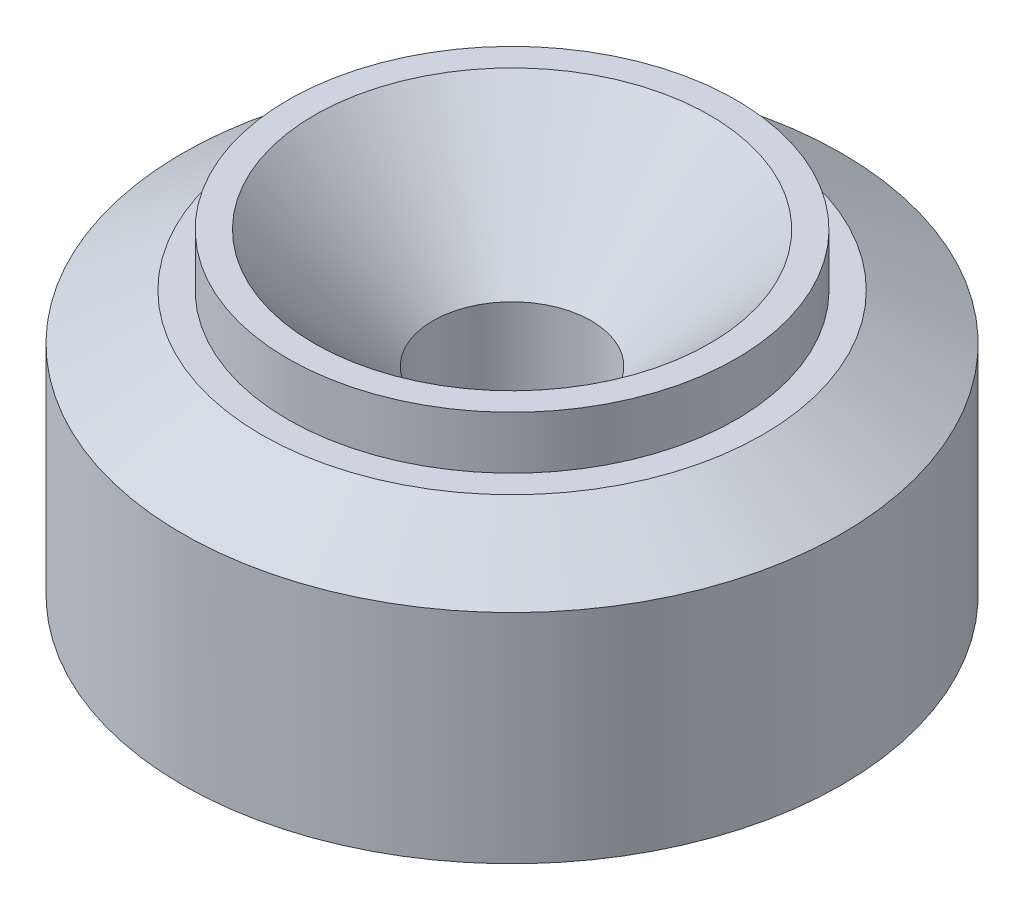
ISO-10303-21;
HEADER;
FILE_DESCRIPTION(('STEP AP214'),'2;1');
FILE_NAME('part.step','',(''),(''),'','','');
FILE_SCHEMA(('AUTOMOTIVE_DESIGN { 1 0 10303 214 1 1 1 1 }'));
ENDSEC;
DATA;
#1=APPLICATION_CONTEXT('core data for automotive mechanical design processes');
#2=APPLICATION_PROTOCOL_DEFINITION('international standard','automotive_design',2000,#1);
#3=PRODUCT_CONTEXT('',#1,'mechanical');
#4=PRODUCT('Part','Part','',(#3));
#5=PRODUCT_RELATED_PRODUCT_CATEGORY('part','',(#4));
#6=PRODUCT_DEFINITION_FORMATION('','',#4);
#7=PRODUCT_DEFINITION_CONTEXT('part definition',#1,'design');
#8=PRODUCT_DEFINITION('design','',#6,#7);
#9=PRODUCT_DEFINITION_SHAPE('','',#8);
#10=(LENGTH_UNIT() NAMED_UNIT(*) SI_UNIT(.MILLI.,.METRE.));
#11=(NAMED_UNIT(*) PLANE_ANGLE_UNIT() SI_UNIT($,.RADIAN.));
#12=(NAMED_UNIT(*) SI_UNIT($,.STERADIAN.) SOLID_ANGLE_UNIT());
#13=UNCERTAINTY_MEASURE_WITH_UNIT(LENGTH_MEASURE(1.E-05),#10,'distance_accuracy_value','');
#14=(GEOMETRIC_REPRESENTATION_CONTEXT(3) GLOBAL_UNCERTAINTY_ASSIGNED_CONTEXT((#13)) GLOBAL_UNIT_ASSIGNED_CONTEXT((#10,
#11,#12)) REPRESENTATION_CONTEXT('',''));
#15=CARTESIAN_POINT('',(0.,0.,0.));
#16=DIRECTION('',(0.,0.,1.));
#17=DIRECTION('',(1.,0.,0.));
#18=AXIS2_PLACEMENT_3D('',#15,#16,#17);
#19=CARTESIAN_POINT('',(0.,12.,0.));
#20=DIRECTION('',(0.,-1.,0.));
#21=DIRECTION('',(0.,0.,-1.));
#22=AXIS2_PLACEMENT_3D('',#19,#20,#21);
#23=CYLINDRICAL_SURFACE('',#22,12.5);
#24=CARTESIAN_POINT('',(0.,8.25,0.));
#25=DIRECTION('',(0.,1.,0.));
#26=DIRECTION('',(0.,0.,1.));
#27=AXIS2_PLACEMENT_3D('',#24,#25,#26);
#28=CIRCLE('',#27,12.5);
#29=CARTESIAN_POINT('',(0.,8.25,-12.5));
#30=VERTEX_POINT('',#29);
#31=EDGE_CURVE('E11',#30,#30,#28,.F.);
#32=ORIENTED_EDGE('',*,*,#31,.T.);
#33=EDGE_LOOP('',(#32));
#34=FACE_BOUND('',#33,.T.);
#35=CARTESIAN_POINT('',(0.,0.,0.));
#36=DIRECTION('',(0.,1.,0.));
#37=DIRECTION('',(0.,0.,1.));
#38=AXIS2_PLACEMENT_3D('',#35,#36,#37);
#39=CIRCLE('',#38,12.5);
#40=CARTESIAN_POINT('',(0.,0.,12.5));
#41=VERTEX_POINT('',#40);
#42=EDGE_CURVE('E43',#41,#41,#39,.T.);
#43=ORIENTED_EDGE('',*,*,#42,.T.);
#44=EDGE_LOOP('',(#43));
#45=FACE_BOUND('',#44,.T.);
#46=ADVANCED_FACE('F32',(#34,#45),#23,.T.);
#47=CARTESIAN_POINT('',(0.,12.,0.));
#48=DIRECTION('',(0.,1.,0.));
#49=DIRECTION('',(0.,0.,1.));
#50=AXIS2_PLACEMENT_3D('',#47,#48,#49);
#51=PLANE('',#50);
#52=CARTESIAN_POINT('',(0.,12.,0.));
#53=DIRECTION('',(0.,1.,0.));
#54=DIRECTION('',(0.,0.,1.));
#55=AXIS2_PLACEMENT_3D('',#52,#53,#54);
#56=CIRCLE('',#55,7.5);
#57=CARTESIAN_POINT('',(0.,12.,7.5));
#58=VERTEX_POINT('',#57);
#59=EDGE_CURVE('E61',#58,#58,#56,.T.);
#60=ORIENTED_EDGE('',*,*,#59,.F.);
#61=EDGE_LOOP('',(#60));
#62=FACE_BOUND('',#61,.T.);
#63=CARTESIAN_POINT('',(0.,12.,0.));
#64=DIRECTION('',(0.,1.,0.));
#65=DIRECTION('',(0.,0.,1.));
#66=AXIS2_PLACEMENT_3D('',#63,#64,#65);
#67=CIRCLE('',#66,8.5);
#68=CARTESIAN_POINT('',(0.,12.,8.5));
#69=VERTEX_POINT('',#68);
#70=EDGE_CURVE('E65',#69,#69,#67,.T.);
#71=ORIENTED_EDGE('',*,*,#70,.T.);
#72=EDGE_LOOP('',(#71));
#73=FACE_BOUND('',#72,.T.);
#74=ADVANCED_FACE('F87',(#62,#73),#51,.T.);
#75=CARTESIAN_POINT('',(0.,0.,0.));
#76=DIRECTION('',(0.,1.,0.));
#77=DIRECTION('',(0.,0.,1.));
#78=AXIS2_PLACEMENT_3D('',#75,#76,#77);
#79=PLANE('',#78);
#80=CARTESIAN_POINT('',(0.,0.,0.));
#81=DIRECTION('',(0.,-1.,0.));
#82=DIRECTION('',(0.,0.,-1.));
#83=AXIS2_PLACEMENT_3D('',#80,#81,#82);
#84=CIRCLE('',#83,7.);
#85=CARTESIAN_POINT('',(0.,0.,-7.));
#86=VERTEX_POINT('',#85);
#87=EDGE_CURVE('E50',#86,#86,#84,.T.);
#88=ORIENTED_EDGE('',*,*,#87,.F.);
#89=EDGE_LOOP('',(#88));
#90=FACE_BOUND('',#89,.T.);
#91=ORIENTED_EDGE('',*,*,#42,.F.);
#92=EDGE_LOOP('',(#91));
#93=FACE_BOUND('',#92,.T.);
#94=ADVANCED_FACE('F91',(#90,#93),#79,.F.);
#95=CARTESIAN_POINT('',(0.,2.,0.));
#96=DIRECTION('',(0.,-1.,0.));
#97=DIRECTION('',(0.,0.,-1.));
#98=AXIS2_PLACEMENT_3D('',#95,#96,#97);
#99=CYLINDRICAL_SURFACE('',#98,7.);
#100=CARTESIAN_POINT('',(0.,2.,0.));
#101=DIRECTION('',(0.,-1.,0.));
#102=DIRECTION('',(0.,0.,-1.));
#103=AXIS2_PLACEMENT_3D('',#100,#101,#102);
#104=CIRCLE('',#103,7.);
#105=CARTESIAN_POINT('',(0.,2.,-7.));
#106=VERTEX_POINT('',#105);
#107=EDGE_CURVE('E47',#106,#106,#104,.T.);
#108=ORIENTED_EDGE('',*,*,#107,.F.);
#109=EDGE_LOOP('',(#108));
#110=FACE_BOUND('',#109,.T.);
#111=ORIENTED_EDGE('',*,*,#87,.T.);
#112=EDGE_LOOP('',(#111));
#113=FACE_BOUND('',#112,.T.);
#114=ADVANCED_FACE('F97',(#110,#113),#99,.F.);
#115=CARTESIAN_POINT('',(0.,2.,0.));
#116=DIRECTION('',(0.,-1.,0.));
#117=DIRECTION('',(0.,0.,-1.));
#118=AXIS2_PLACEMENT_3D('',#115,#116,#117);
#119=PLANE('',#118);
#120=CARTESIAN_POINT('',(0.,2.,0.));
#121=DIRECTION('',(0.,-1.,0.));
#122=DIRECTION('',(0.,0.,-1.));
#123=AXIS2_PLACEMENT_3D('',#120,#121,#122);
#124=CIRCLE('',#123,3.);
#125=CARTESIAN_POINT('',(0.,2.,-3.));
#126=VERTEX_POINT('',#125);
#127=EDGE_CURVE('E53',#126,#126,#124,.T.);
#128=ORIENTED_EDGE('',*,*,#127,.F.);
#129=EDGE_LOOP('',(#128));
#130=FACE_BOUND('',#129,.T.);
#131=ORIENTED_EDGE('',*,*,#107,.T.);
#132=EDGE_LOOP('',(#131));
#133=FACE_BOUND('',#132,.T.);
#134=ADVANCED_FACE('F102',(#130,#133),#119,.T.);
#135=CARTESIAN_POINT('',(0.,7.5,0.));
#136=DIRECTION('',(0.,-1.,0.));
#137=DIRECTION('',(0.,0.,-1.));
#138=AXIS2_PLACEMENT_3D('',#135,#136,#137);
#139=CYLINDRICAL_SURFACE('',#138,3.);
#140=CARTESIAN_POINT('',(0.,7.5,0.));
#141=DIRECTION('',(0.,1.,0.));
#142=DIRECTION('',(0.,0.,1.));
#143=AXIS2_PLACEMENT_3D('',#140,#141,#142);
#144=CIRCLE('',#143,2.99999999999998);
#145=CARTESIAN_POINT('',(0.,7.5,2.99999999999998));
#146=VERTEX_POINT('',#145);
#147=EDGE_CURVE('E58',#146,#146,#144,.T.);
#148=ORIENTED_EDGE('',*,*,#147,.T.);
#149=EDGE_LOOP('',(#148));
#150=FACE_BOUND('',#149,.T.);
#151=ORIENTED_EDGE('',*,*,#127,.T.);
#152=EDGE_LOOP('',(#151));
#153=FACE_BOUND('',#152,.T.);
#154=ADVANCED_FACE('F83',(#150,#153),#139,.F.);
#155=CARTESIAN_POINT('',(0.,12.,0.));
#156=DIRECTION('',(0.,1.,0.));
#157=DIRECTION('',(0.,0.,1.));
#158=AXIS2_PLACEMENT_3D('',#155,#156,#157);
#159=CONICAL_SURFACE('',#158,7.5,0.78539816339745);
#160=ORIENTED_EDGE('',*,*,#147,.F.);
#161=EDGE_LOOP('',(#160));
#162=FACE_BOUND('',#161,.T.);
#163=ORIENTED_EDGE('',*,*,#59,.T.);
#164=EDGE_LOOP('',(#163));
#165=FACE_BOUND('',#164,.T.);
#166=ADVANCED_FACE('F76',(#162,#165),#159,.F.);
#167=CARTESIAN_POINT('',(0.,10.,0.));
#168=DIRECTION('',(0.,1.,0.));
#169=DIRECTION('',(0.,0.,1.));
#170=AXIS2_PLACEMENT_3D('',#167,#168,#169);
#171=PLANE('',#170);
#172=CARTESIAN_POINT('',(0.,10.,0.));
#173=DIRECTION('',(0.,1.,0.));
#174=DIRECTION('',(0.,0.,1.));
#175=AXIS2_PLACEMENT_3D('',#172,#173,#174);
#176=CIRCLE('',#175,9.49999999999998);
#177=CARTESIAN_POINT('',(0.,10.,-9.49999999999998));
#178=VERTEX_POINT('',#177);
#179=EDGE_CURVE('E39',#178,#178,#176,.T.);
#180=ORIENTED_EDGE('',*,*,#179,.T.);
#181=EDGE_LOOP('',(#180));
#182=FACE_BOUND('',#181,.T.);
#183=CARTESIAN_POINT('',(0.,10.,0.));
#184=DIRECTION('',(0.,1.,0.));
#185=DIRECTION('',(0.,0.,1.));
#186=AXIS2_PLACEMENT_3D('',#183,#184,#185);
#187=CIRCLE('',#186,8.5);
#188=CARTESIAN_POINT('',(0.,10.,8.5));
#189=VERTEX_POINT('',#188);
#190=EDGE_CURVE('E64',#189,#189,#187,.T.);
#191=ORIENTED_EDGE('',*,*,#190,.F.);
#192=EDGE_LOOP('',(#191));
#193=FACE_BOUND('',#192,.T.);
#194=ADVANCED_FACE('F74',(#182,#193),#171,.T.);
#195=CARTESIAN_POINT('',(0.,10.,0.));
#196=DIRECTION('',(0.,1.,0.));
#197=DIRECTION('',(0.,0.,1.));
#198=AXIS2_PLACEMENT_3D('',#195,#196,#197);
#199=CYLINDRICAL_SURFACE('',#198,8.5);
#200=ORIENTED_EDGE('',*,*,#190,.T.);
#201=EDGE_LOOP('',(#200));
#202=FACE_BOUND('',#201,.T.);
#203=ORIENTED_EDGE('',*,*,#70,.F.);
#204=EDGE_LOOP('',(#203));
#205=FACE_BOUND('',#204,.T.);
#206=ADVANCED_FACE('F71',(#202,#205),#199,.T.);
#207=CARTESIAN_POINT('',(0.,10.,0.));
#208=DIRECTION('',(0.,-1.,0.));
#209=DIRECTION('',(0.,0.,-1.));
#210=AXIS2_PLACEMENT_3D('',#207,#208,#209);
#211=CONICAL_SURFACE('',#210,9.49999999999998,1.04272187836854);
#212=CARTESIAN_POINT('',(0.,8.25,-12.5));
#213=CARTESIAN_POINT('',(0.,8.26822916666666,-12.46875));
#214=CARTESIAN_POINT('',(0.,8.28645833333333,-12.4375));
#215=CARTESIAN_POINT('',(0.,8.32291666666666,-12.375));
#216=CARTESIAN_POINT('',(0.,8.34114583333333,-12.34375));
#217=CARTESIAN_POINT('',(0.,8.37760416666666,-12.28125));
#218=CARTESIAN_POINT('',(0.,8.39583333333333,-12.25));
#219=CARTESIAN_POINT('',(0.,8.43229166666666,-12.1875));
#220=CARTESIAN_POINT('',(0.,8.45052083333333,-12.15625));
#221=CARTESIAN_POINT('',(0.,8.48697916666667,-12.09375));
#222=CARTESIAN_POINT('',(0.,8.50520833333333,-12.0625));
#223=CARTESIAN_POINT('',(0.,8.54166666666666,-12.));
#224=CARTESIAN_POINT('',(0.,8.55989583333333,-11.96875));
#225=CARTESIAN_POINT('',(0.,8.59635416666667,-11.90625));
#226=CARTESIAN_POINT('',(0.,8.61458333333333,-11.875));
#227=CARTESIAN_POINT('',(0.,8.65104166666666,-11.8125));
#228=CARTESIAN_POINT('',(0.,8.66927083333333,-11.78125));
#229=CARTESIAN_POINT('',(0.,8.70572916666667,-11.71875));
#230=CARTESIAN_POINT('',(0.,8.72395833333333,-11.6875));
#231=CARTESIAN_POINT('',(0.,8.76041666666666,-11.625));
#232=CARTESIAN_POINT('',(0.,8.77864583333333,-11.59375));
#233=CARTESIAN_POINT('',(0.,8.81510416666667,-11.53125));
#234=CARTESIAN_POINT('',(0.,8.83333333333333,-11.5));
#235=CARTESIAN_POINT('',(0.,8.86979166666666,-11.4375));
#236=CARTESIAN_POINT('',(0.,8.88802083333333,-11.40625));
#237=CARTESIAN_POINT('',(0.,8.92447916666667,-11.34375));
#238=CARTESIAN_POINT('',(0.,8.94270833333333,-11.3125));
#239=CARTESIAN_POINT('',(0.,8.97916666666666,-11.25));
#240=CARTESIAN_POINT('',(0.,8.99739583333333,-11.21875));
#241=CARTESIAN_POINT('',(0.,9.03385416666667,-11.15625));
#242=CARTESIAN_POINT('',(0.,9.05208333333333,-11.125));
#243=CARTESIAN_POINT('',(0.,9.08854166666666,-11.0625));
#244=CARTESIAN_POINT('',(0.,9.10677083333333,-11.03125));
#245=CARTESIAN_POINT('',(0.,9.14322916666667,-10.96875));
#246=CARTESIAN_POINT('',(0.,9.16145833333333,-10.9375));
#247=CARTESIAN_POINT('',(0.,9.19791666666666,-10.875));
#248=CARTESIAN_POINT('',(0.,9.21614583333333,-10.84375));
#249=CARTESIAN_POINT('',(0.,9.25260416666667,-10.78125));
#250=CARTESIAN_POINT('',(0.,9.27083333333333,-10.75));
#251=CARTESIAN_POINT('',(0.,9.30729166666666,-10.6875));
#252=CARTESIAN_POINT('',(0.,9.32552083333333,-10.65625));
#253=CARTESIAN_POINT('',(0.,9.36197916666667,-10.59375));
#254=CARTESIAN_POINT('',(0.,9.38020833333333,-10.5625));
#255=CARTESIAN_POINT('',(0.,9.41666666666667,-10.5));
#256=CARTESIAN_POINT('',(0.,9.43489583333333,-10.46875));
#257=CARTESIAN_POINT('',(0.,9.47135416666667,-10.40625));
#258=CARTESIAN_POINT('',(0.,9.48958333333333,-10.375));
#259=CARTESIAN_POINT('',(0.,9.52604166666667,-10.3125));
#260=CARTESIAN_POINT('',(0.,9.54427083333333,-10.28125));
#261=CARTESIAN_POINT('',(0.,9.58072916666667,-10.21875));
#262=CARTESIAN_POINT('',(0.,9.59895833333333,-10.1875));
#263=CARTESIAN_POINT('',(0.,9.63541666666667,-10.125));
#264=CARTESIAN_POINT('',(0.,9.65364583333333,-10.09375));
#265=CARTESIAN_POINT('',(0.,9.69010416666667,-10.03125));
#266=CARTESIAN_POINT('',(0.,9.70833333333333,-9.99999999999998));
#267=CARTESIAN_POINT('',(0.,9.74479166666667,-9.93749999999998));
#268=CARTESIAN_POINT('',(0.,9.76302083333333,-9.90624999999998));
#269=CARTESIAN_POINT('',(0.,9.79947916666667,-9.84374999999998));
#270=CARTESIAN_POINT('',(0.,9.81770833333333,-9.81249999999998));
#271=CARTESIAN_POINT('',(0.,9.85416666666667,-9.74999999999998));
#272=CARTESIAN_POINT('',(0.,9.87239583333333,-9.71874999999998));
#273=CARTESIAN_POINT('',(0.,9.90885416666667,-9.65624999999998));
#274=CARTESIAN_POINT('',(0.,9.92708333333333,-9.62499999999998));
#275=CARTESIAN_POINT('',(0.,9.96354166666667,-9.56249999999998));
#276=CARTESIAN_POINT('',(0.,9.98177083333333,-9.53124999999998));
#277=CARTESIAN_POINT('',(0.,10.,-9.49999999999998));
#278=B_SPLINE_CURVE_WITH_KNOTS('',3,(#212,#213,#214,#215,#216,#217,#218,#219,#220,#221,#222,
#223,#224,#225,#226,#227,#228,#229,#230,#231,#232,#233,#234,#235,#236,#237,#238,#239,#240,#241,
#242,#243,#244,#245,#246,#247,#248,#249,#250,#251,#252,#253,#254,#255,#256,#257,#258,#259,#260,
#261,#262,#263,#264,#265,#266,#267,#268,#269,#270,#271,#272,#273,#274,#275,#276,#277),
.UNSPECIFIED.,.F.,.F.,(4,2,2,2,2,2,2,2,2,2,2,2,2,2,2,2,2,2,2,2,2,2,2,2,2,2,2,2,2,2,2,2,4),(0.,
0.108534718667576,0.217069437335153,0.32560415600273,0.434138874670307,0.542673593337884,
0.651208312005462,0.759743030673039,0.868277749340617,0.976812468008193,1.08534718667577,
1.19388190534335,1.30241662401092,1.4109513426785,1.51948606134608,1.62802078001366,
1.73655549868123,1.84509021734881,1.95362493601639,2.06215965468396,2.17069437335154,
2.27922909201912,2.3877638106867,2.49629852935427,2.60483324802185,2.71336796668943,
2.821902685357,2.93043740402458,3.03897212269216,3.14750684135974,3.25604156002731,
3.36457627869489,3.47311099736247),.UNSPECIFIED.);
#279=EDGE_CURVE('BSEAM34',#30,#178,#278,.T.);
#280=ORIENTED_EDGE('',*,*,#31,.F.);
#281=ORIENTED_EDGE('',*,*,#179,.F.);
#282=ORIENTED_EDGE('',*,*,#279,.T.);
#283=ORIENTED_EDGE('',*,*,#279,.F.);
#284=EDGE_LOOP('',(#280,#282,#281,#283));
#285=FACE_BOUND('',#284,.T.);
#286=ADVANCED_FACE('F34',(#285),#211,.T.);
#287=CLOSED_SHELL('',(#46,#74,#94,#114,#134,#154,#166,#194,#206,#286));
#288=MANIFOLD_SOLID_BREP('B2',#287);
#289=ADVANCED_BREP_SHAPE_REPRESENTATION('',(#18,#288),#14);
#290=SHAPE_DEFINITION_REPRESENTATION(#9,#289);
ENDSEC;
END-ISO-10303-21;
